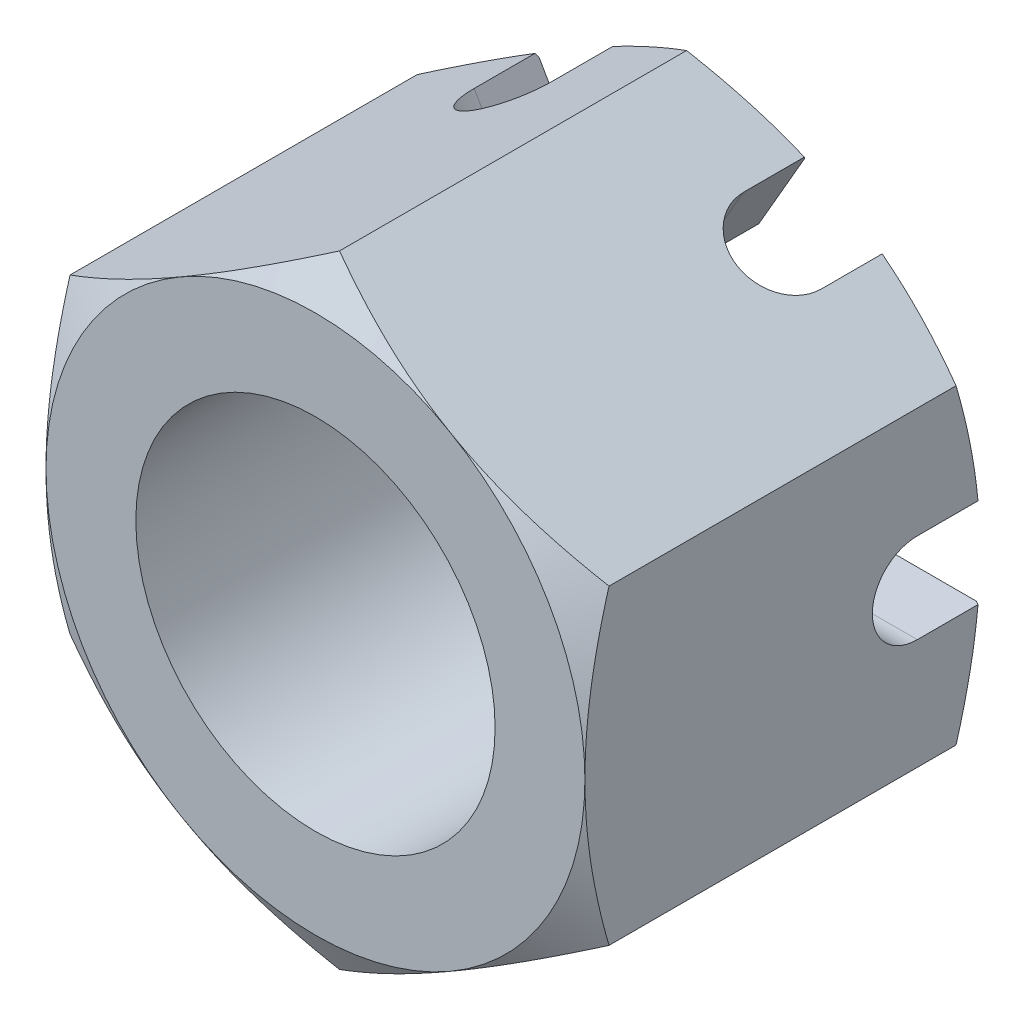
from build123d import *

# Parameters (mm, degrees)
BASE_EXTRUSION_DEPTH         = 22
ESQUISSE3_R                  = 10
ENL_V_MAT_EXTRU_1_DEPTH      = 32.764760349
ENL_V_MAT_EXTRU_2_DEPTH      = 42.036569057
R_P_TITION_CIRCULAIRE1_COUNT = 3


with BuildPart() as part:
    # Esquisse1 → Base-Extrusion (new body)
    with BuildSketch(Plane.XY):
        Polygon((15, -8.660254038), (15, 8.660254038), (0, 17.320508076), (-15, 8.660254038), (-15, -8.660254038), (0, -17.320508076), align=None)
    extrude(amount=-BASE_EXTRUSION_DEPTH)

    # Esquisse2 → Enl_vement de mati_re-R_volution1 (revolve, cut)
    with BuildSketch(Plane(origin=(0, 0, 0), x_dir=(1, 0, 0), z_dir=(0, 1, 0)), mode=Mode.PRIVATE) as enl_vement_de_mati_re_r_volution1_sk:
        Polygon((-15, 0), (-35.052558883, 0), (-35.052558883, 22), (-15, 22), (-34.052558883, 11), align=None)
    revolve(enl_vement_de_mati_re_r_volution1_sk.sketch.rotate(Axis((0, 0, -22), (0, 0, 1)), 180), axis=Axis((0, 0, -22), (0, 0, 1)), mode=Mode.SUBTRACT)

    # Esquisse3 → Enl_v. mat.-Extru.1 (cut, through all)
    with BuildSketch(Plane.XY):
        Circle(ESQUISSE3_R)
    extrude(amount=-ENL_V_MAT_EXTRU_1_DEPTH, mode=Mode.SUBTRACT)

    # Esquisse4 → Enl_v. mat.-Extru.2 (cut, through all)
    with BuildSketch(Plane(origin=(15, 0, 0), x_dir=(0, 0, -1), z_dir=(1, 0, 0))):
        with BuildLine():
            Line((18.5, 2.5), (22, 2.5))
            Line((22, 2.5), (22, -2.5))
            Line((22, -2.5), (18.5, -2.5))
            ThreePointArc((18.5, -2.5), (16, 0), (18.5, 2.5))
        make_face()
    enl_v_mat_extru_2 = extrude(amount=-ENL_V_MAT_EXTRU_2_DEPTH, mode=Mode.SUBTRACT)

    # R_p_tition circulaire1: Enl_v. mat.-Extru.2 ×3 about axis
    r_p_tition_circulaire1_axis = Axis((0, 0, -50), (0, 0, 1))
    for i in range(1, R_P_TITION_CIRCULAIRE1_COUNT):
        add(enl_v_mat_extru_2.rotate(r_p_tition_circulaire1_axis, i * 360 / R_P_TITION_CIRCULAIRE1_COUNT), mode=Mode.SUBTRACT)


solid = part.part
